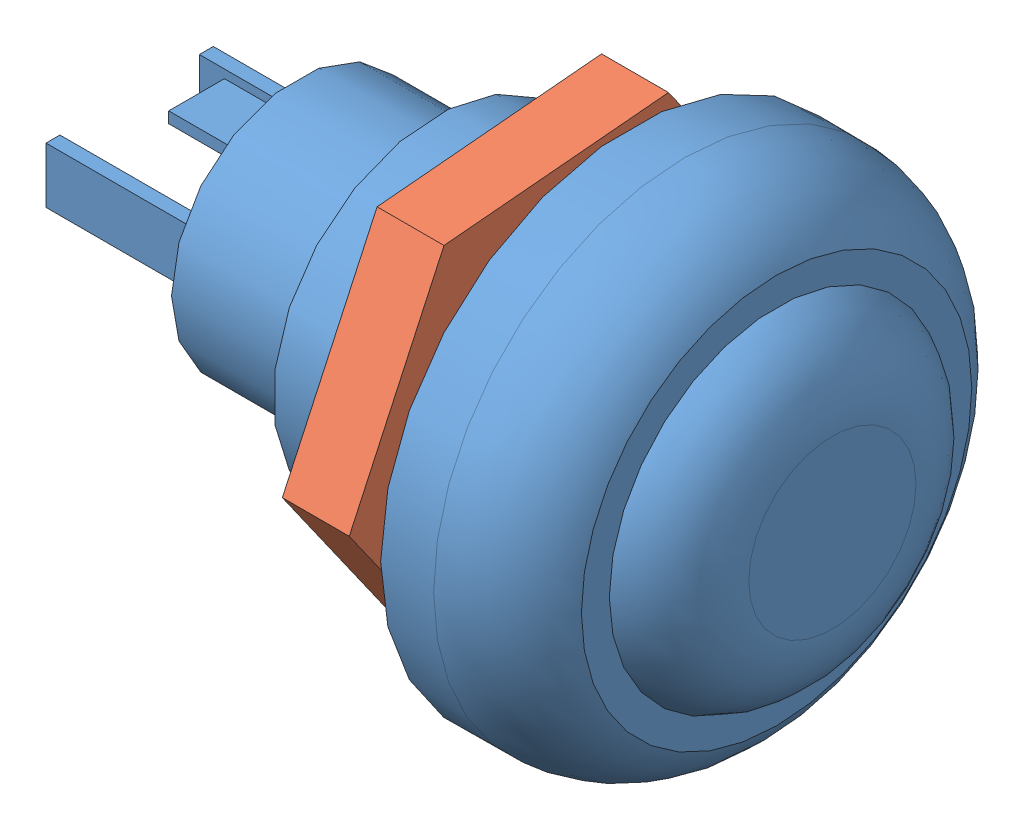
SolidWorks assembly TlačítkoFarnel 5-D8.SLDPRT.SLDASM, configuration Výchozí (file format 5000). Lengths in mm.
Overall size (25.2 21.28 20.75).
2 component instances, 2 part files, 2 mates.
Components (placement in the parent):
- Tlačítko 5-D8-1: Tlačítko 5-D8.SLDPRT [Výchozí] at origin size (25.2 18 18)
- matka tlačítka 5-D8-1: matka tlačítka 5-D8.SLDPRT [Výchozí] at (7.5258 0 0) x (0 -0.817687 -0.575663) z (1 0 0) size (16.17 14 2.4)
Mates (geometry in assembly coordinates):
- Soustředná2: concentric anti-aligned: cylinder of Tlačítko 5-D8-1 through (0 0 0) axis (1 0 0) radius 5.85; cylinder of matka tlačítka 5-D8-1 through (9.9258 0 0) axis (-1 0 0) radius 5.5
- Soustředná3: concentric anti-aligned: cylinder of Tlačítko 5-D8-1 through (0 0 0) axis (1 0 0) radius 5.85; cylinder of matka tlačítka 5-D8-1 through (9.9258 0 0) axis (-1 0 0) radius 5.5
